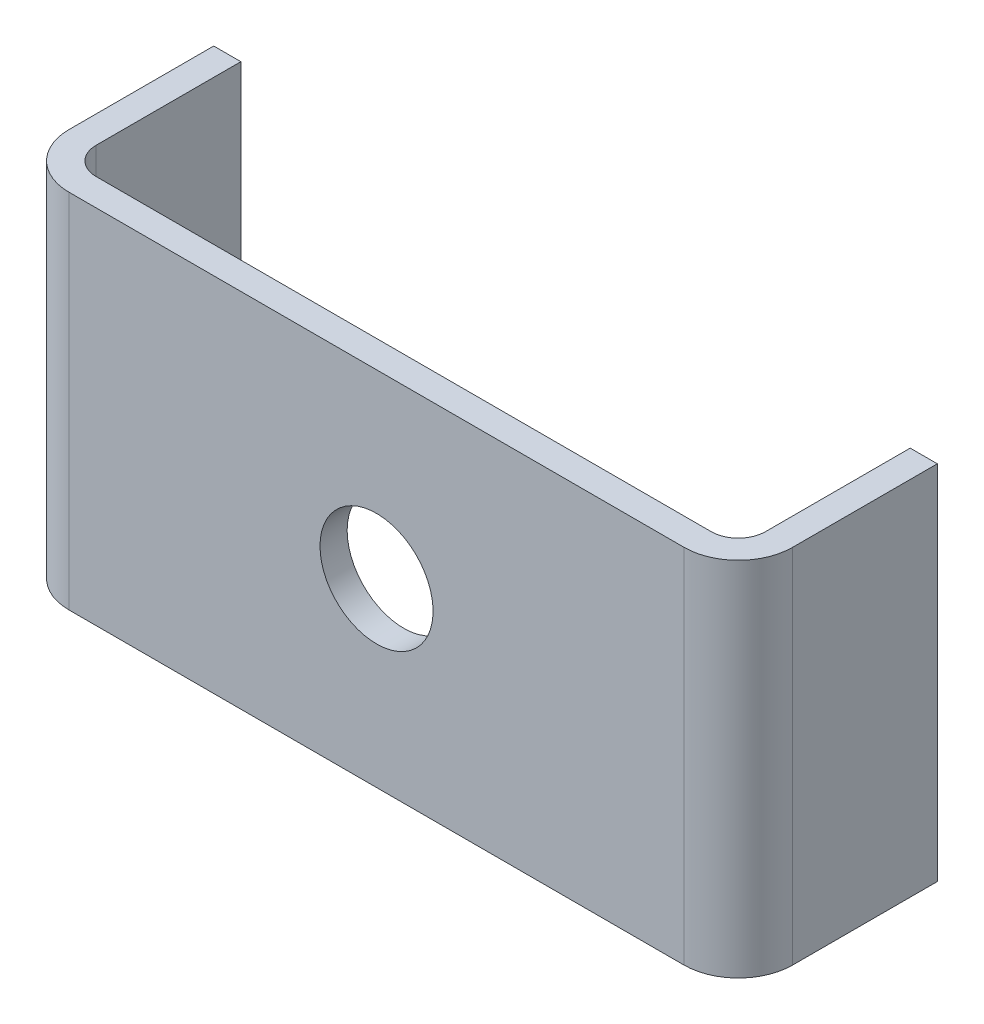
ISO-10303-21;
HEADER;
FILE_DESCRIPTION(('STEP AP214'),'2;1');
FILE_NAME('part.step','',(''),(''),'','','');
FILE_SCHEMA(('AUTOMOTIVE_DESIGN { 1 0 10303 214 1 1 1 1 }'));
ENDSEC;
DATA;
#1=APPLICATION_CONTEXT('core data for automotive mechanical design processes');
#2=APPLICATION_PROTOCOL_DEFINITION('international standard','automotive_design',2000,#1);
#3=PRODUCT_CONTEXT('',#1,'mechanical');
#4=PRODUCT('Part','Part','',(#3));
#5=PRODUCT_RELATED_PRODUCT_CATEGORY('part','',(#4));
#6=PRODUCT_DEFINITION_FORMATION('','',#4);
#7=PRODUCT_DEFINITION_CONTEXT('part definition',#1,'design');
#8=PRODUCT_DEFINITION('design','',#6,#7);
#9=PRODUCT_DEFINITION_SHAPE('','',#8);
#10=(LENGTH_UNIT() NAMED_UNIT(*) SI_UNIT(.MILLI.,.METRE.));
#11=(NAMED_UNIT(*) PLANE_ANGLE_UNIT() SI_UNIT($,.RADIAN.));
#12=(NAMED_UNIT(*) SI_UNIT($,.STERADIAN.) SOLID_ANGLE_UNIT());
#13=UNCERTAINTY_MEASURE_WITH_UNIT(LENGTH_MEASURE(1.E-05),#10,'distance_accuracy_value','');
#14=(GEOMETRIC_REPRESENTATION_CONTEXT(3) GLOBAL_UNCERTAINTY_ASSIGNED_CONTEXT((#13)) GLOBAL_UNIT_ASSIGNED_CONTEXT((#10,
#11,#12)) REPRESENTATION_CONTEXT('',''));
#15=CARTESIAN_POINT('',(0.,0.,0.));
#16=DIRECTION('',(0.,0.,1.));
#17=DIRECTION('',(1.,0.,0.));
#18=AXIS2_PLACEMENT_3D('',#15,#16,#17);
#19=CARTESIAN_POINT('',(0.,0.,-22.));
#20=DIRECTION('',(0.,0.,-1.));
#21=DIRECTION('',(-1.,0.,0.));
#22=AXIS2_PLACEMENT_3D('',#19,#20,#21);
#23=PLANE('',#22);
#24=DIRECTION('',(0.,-1.,0.));
#25=VECTOR('',#24,1.);
#26=CARTESIAN_POINT('',(-37.,20.,-22.));
#27=LINE('',#26,#25);
#28=CARTESIAN_POINT('',(-37.,20.,-22.));
#29=VERTEX_POINT('',#28);
#30=CARTESIAN_POINT('',(-37.,-20.,-22.));
#31=VERTEX_POINT('',#30);
#32=EDGE_CURVE('E143',#29,#31,#27,.T.);
#33=ORIENTED_EDGE('',*,*,#32,.T.);
#34=DIRECTION('',(-1.,0.,0.));
#35=VECTOR('',#34,1.);
#36=CARTESIAN_POINT('',(40.,-20.,-22.));
#37=LINE('',#36,#35);
#38=CARTESIAN_POINT('',(-40.,-20.,-22.));
#39=VERTEX_POINT('',#38);
#40=EDGE_CURVE('E150',#31,#39,#37,.T.);
#41=ORIENTED_EDGE('',*,*,#40,.T.);
#42=DIRECTION('',(0.,1.,0.));
#43=VECTOR('',#42,1.);
#44=CARTESIAN_POINT('',(-40.,-20.,-22.));
#45=LINE('',#44,#43);
#46=CARTESIAN_POINT('',(-40.,20.,-22.));
#47=VERTEX_POINT('',#46);
#48=EDGE_CURVE('E153',#39,#47,#45,.T.);
#49=ORIENTED_EDGE('',*,*,#48,.T.);
#50=DIRECTION('',(1.,0.,0.));
#51=VECTOR('',#50,1.);
#52=CARTESIAN_POINT('',(-40.,20.,-22.));
#53=LINE('',#52,#51);
#54=EDGE_CURVE('E131',#47,#29,#53,.T.);
#55=ORIENTED_EDGE('',*,*,#54,.T.);
#56=EDGE_LOOP('',(#33,#41,#49,#55));
#57=FACE_BOUND('',#56,.T.);
#58=ADVANCED_FACE('F35',(#57),#23,.T.);
#59=CARTESIAN_POINT('',(40.,-20.,0.));
#60=DIRECTION('',(0.,-1.,0.));
#61=DIRECTION('',(0.,0.,-1.));
#62=AXIS2_PLACEMENT_3D('',#59,#60,#61);
#63=PLANE('',#62);
#64=DIRECTION('',(-1.,0.,0.));
#65=VECTOR('',#64,1.);
#66=CARTESIAN_POINT('',(40.,-20.,0.));
#67=LINE('',#66,#65);
#68=CARTESIAN_POINT('',(34.,-20.,0.));
#69=VERTEX_POINT('',#68);
#70=CARTESIAN_POINT('',(-34.,-20.,0.));
#71=VERTEX_POINT('',#70);
#72=EDGE_CURVE('E158',#69,#71,#67,.T.);
#73=ORIENTED_EDGE('',*,*,#72,.T.);
#74=CARTESIAN_POINT('',(-34.,-20.,-6.));
#75=DIRECTION('',(0.,-1.,0.));
#76=DIRECTION('',(0.,0.,-1.));
#77=AXIS2_PLACEMENT_3D('',#74,#75,#76);
#78=CIRCLE('',#77,6.);
#79=CARTESIAN_POINT('',(-40.,-20.,-6.));
#80=VERTEX_POINT('',#79);
#81=EDGE_CURVE('E43',#71,#80,#78,.T.);
#82=ORIENTED_EDGE('',*,*,#81,.T.);
#83=DIRECTION('',(0.,0.,-1.));
#84=VECTOR('',#83,1.);
#85=CARTESIAN_POINT('',(-40.,-20.,0.));
#86=LINE('',#85,#84);
#87=EDGE_CURVE('E171',#80,#39,#86,.T.);
#88=ORIENTED_EDGE('',*,*,#87,.T.);
#89=ORIENTED_EDGE('',*,*,#40,.F.);
#90=DIRECTION('',(0.,0.,-1.));
#91=VECTOR('',#90,1.);
#92=CARTESIAN_POINT('',(-37.,-20.,-3.));
#93=LINE('',#92,#91);
#94=CARTESIAN_POINT('',(-37.,-20.,-6.));
#95=VERTEX_POINT('',#94);
#96=EDGE_CURVE('E146',#95,#31,#93,.T.);
#97=ORIENTED_EDGE('',*,*,#96,.F.);
#98=CARTESIAN_POINT('',(-34.,-20.,-6.));
#99=DIRECTION('',(0.,-1.,0.));
#100=DIRECTION('',(0.,0.,-1.));
#101=AXIS2_PLACEMENT_3D('',#98,#99,#100);
#102=CIRCLE('',#101,3.);
#103=CARTESIAN_POINT('',(-34.,-20.,-3.));
#104=VERTEX_POINT('',#103);
#105=EDGE_CURVE('E186',#95,#104,#102,.F.);
#106=ORIENTED_EDGE('',*,*,#105,.T.);
#107=DIRECTION('',(-1.,0.,0.));
#108=VECTOR('',#107,1.);
#109=CARTESIAN_POINT('',(37.,-20.,-3.));
#110=LINE('',#109,#108);
#111=CARTESIAN_POINT('',(34.,-20.,-3.));
#112=VERTEX_POINT('',#111);
#113=EDGE_CURVE('E222',#112,#104,#110,.T.);
#114=ORIENTED_EDGE('',*,*,#113,.F.);
#115=CARTESIAN_POINT('',(34.,-20.,-6.));
#116=DIRECTION('',(0.,-1.,0.));
#117=DIRECTION('',(0.,0.,-1.));
#118=AXIS2_PLACEMENT_3D('',#115,#116,#117);
#119=CIRCLE('',#118,3.);
#120=CARTESIAN_POINT('',(37.,-20.,-6.));
#121=VERTEX_POINT('',#120);
#122=EDGE_CURVE('E182',#112,#121,#119,.F.);
#123=ORIENTED_EDGE('',*,*,#122,.T.);
#124=DIRECTION('',(0.,0.,1.));
#125=VECTOR('',#124,1.);
#126=CARTESIAN_POINT('',(37.,-20.,-22.));
#127=LINE('',#126,#125);
#128=CARTESIAN_POINT('',(37.,-20.,-22.));
#129=VERTEX_POINT('',#128);
#130=EDGE_CURVE('E226',#129,#121,#127,.T.);
#131=ORIENTED_EDGE('',*,*,#130,.F.);
#132=CARTESIAN_POINT('',(40.,-20.,-22.));
#133=VERTEX_POINT('',#132);
#134=EDGE_CURVE('E214',#133,#129,#37,.T.);
#135=ORIENTED_EDGE('',*,*,#134,.F.);
#136=DIRECTION('',(0.,0.,-1.));
#137=VECTOR('',#136,1.);
#138=CARTESIAN_POINT('',(40.,-20.,0.));
#139=LINE('',#138,#137);
#140=CARTESIAN_POINT('',(40.,-20.,-6.));
#141=VERTEX_POINT('',#140);
#142=EDGE_CURVE('E164',#141,#133,#139,.T.);
#143=ORIENTED_EDGE('',*,*,#142,.F.);
#144=CARTESIAN_POINT('',(34.,-20.,-6.));
#145=DIRECTION('',(0.,-1.,0.));
#146=DIRECTION('',(0.,0.,-1.));
#147=AXIS2_PLACEMENT_3D('',#144,#145,#146);
#148=CIRCLE('',#147,6.);
#149=EDGE_CURVE('E50',#141,#69,#148,.T.);
#150=ORIENTED_EDGE('',*,*,#149,.T.);
#151=EDGE_LOOP('',(#73,#82,#88,#89,#97,#106,#114,#123,#131,#135,#143,#150));
#152=FACE_BOUND('',#151,.T.);
#153=ADVANCED_FACE('F202',(#152),#63,.T.);
#154=CARTESIAN_POINT('',(40.,20.,0.));
#155=DIRECTION('',(1.,0.,0.));
#156=DIRECTION('',(0.,0.,-1.));
#157=AXIS2_PLACEMENT_3D('',#154,#155,#156);
#158=PLANE('',#157);
#159=DIRECTION('',(0.,0.,-1.));
#160=VECTOR('',#159,1.);
#161=CARTESIAN_POINT('',(40.,20.,0.));
#162=LINE('',#161,#160);
#163=CARTESIAN_POINT('',(40.,20.,-6.));
#164=VERTEX_POINT('',#163);
#165=CARTESIAN_POINT('',(40.,20.,-22.));
#166=VERTEX_POINT('',#165);
#167=EDGE_CURVE('E167',#164,#166,#162,.T.);
#168=ORIENTED_EDGE('',*,*,#167,.F.);
#169=DIRECTION('',(0.,-1.,0.));
#170=VECTOR('',#169,1.);
#171=CARTESIAN_POINT('',(40.,-20.,-6.));
#172=LINE('',#171,#170);
#173=EDGE_CURVE('E11',#164,#141,#172,.T.);
#174=ORIENTED_EDGE('',*,*,#173,.T.);
#175=ORIENTED_EDGE('',*,*,#142,.T.);
#176=DIRECTION('',(0.,-1.,0.));
#177=VECTOR('',#176,1.);
#178=CARTESIAN_POINT('',(40.,20.,-22.));
#179=LINE('',#178,#177);
#180=EDGE_CURVE('E154',#166,#133,#179,.T.);
#181=ORIENTED_EDGE('',*,*,#180,.F.);
#182=EDGE_LOOP('',(#168,#174,#175,#181));
#183=FACE_BOUND('',#182,.T.);
#184=ADVANCED_FACE('F261',(#183),#158,.T.);
#185=CARTESIAN_POINT('',(-40.,20.,0.));
#186=DIRECTION('',(0.,1.,0.));
#187=DIRECTION('',(0.,0.,1.));
#188=AXIS2_PLACEMENT_3D('',#185,#186,#187);
#189=PLANE('',#188);
#190=DIRECTION('',(0.,0.,-1.));
#191=VECTOR('',#190,1.);
#192=CARTESIAN_POINT('',(-40.,20.,0.));
#193=LINE('',#192,#191);
#194=CARTESIAN_POINT('',(-40.,20.,-6.));
#195=VERTEX_POINT('',#194);
#196=EDGE_CURVE('E169',#195,#47,#193,.T.);
#197=ORIENTED_EDGE('',*,*,#196,.F.);
#198=CARTESIAN_POINT('',(-34.,20.,-6.));
#199=DIRECTION('',(0.,1.,0.));
#200=DIRECTION('',(0.,0.,1.));
#201=AXIS2_PLACEMENT_3D('',#198,#199,#200);
#202=CIRCLE('',#201,6.);
#203=CARTESIAN_POINT('',(-34.,20.,0.));
#204=VERTEX_POINT('',#203);
#205=EDGE_CURVE('E194',#195,#204,#202,.T.);
#206=ORIENTED_EDGE('',*,*,#205,.T.);
#207=DIRECTION('',(1.,0.,0.));
#208=VECTOR('',#207,1.);
#209=CARTESIAN_POINT('',(-40.,20.,0.));
#210=LINE('',#209,#208);
#211=CARTESIAN_POINT('',(34.,20.,0.));
#212=VERTEX_POINT('',#211);
#213=EDGE_CURVE('E173',#204,#212,#210,.T.);
#214=ORIENTED_EDGE('',*,*,#213,.T.);
#215=CARTESIAN_POINT('',(34.,20.,-6.));
#216=DIRECTION('',(0.,1.,0.));
#217=DIRECTION('',(0.,0.,1.));
#218=AXIS2_PLACEMENT_3D('',#215,#216,#217);
#219=CIRCLE('',#218,6.);
#220=EDGE_CURVE('E192',#212,#164,#219,.T.);
#221=ORIENTED_EDGE('',*,*,#220,.T.);
#222=ORIENTED_EDGE('',*,*,#167,.T.);
#223=CARTESIAN_POINT('',(37.,20.,-22.));
#224=VERTEX_POINT('',#223);
#225=EDGE_CURVE('E155',#224,#166,#53,.T.);
#226=ORIENTED_EDGE('',*,*,#225,.F.);
#227=DIRECTION('',(0.,0.,1.));
#228=VECTOR('',#227,1.);
#229=CARTESIAN_POINT('',(37.,20.,-22.));
#230=LINE('',#229,#228);
#231=CARTESIAN_POINT('',(37.,20.,-6.));
#232=VERTEX_POINT('',#231);
#233=EDGE_CURVE('E221',#224,#232,#230,.T.);
#234=ORIENTED_EDGE('',*,*,#233,.T.);
#235=CARTESIAN_POINT('',(34.,20.,-6.));
#236=DIRECTION('',(0.,1.,0.));
#237=DIRECTION('',(0.,0.,1.));
#238=AXIS2_PLACEMENT_3D('',#235,#236,#237);
#239=CIRCLE('',#238,3.);
#240=CARTESIAN_POINT('',(34.,20.,-3.));
#241=VERTEX_POINT('',#240);
#242=EDGE_CURVE('E184',#232,#241,#239,.F.);
#243=ORIENTED_EDGE('',*,*,#242,.T.);
#244=DIRECTION('',(-1.,0.,0.));
#245=VECTOR('',#244,1.);
#246=CARTESIAN_POINT('',(37.,20.,-3.));
#247=LINE('',#246,#245);
#248=CARTESIAN_POINT('',(-34.,20.,-3.));
#249=VERTEX_POINT('',#248);
#250=EDGE_CURVE('E140',#241,#249,#247,.T.);
#251=ORIENTED_EDGE('',*,*,#250,.T.);
#252=CARTESIAN_POINT('',(-34.,20.,-6.));
#253=DIRECTION('',(0.,1.,0.));
#254=DIRECTION('',(0.,0.,1.));
#255=AXIS2_PLACEMENT_3D('',#252,#253,#254);
#256=CIRCLE('',#255,3.);
#257=CARTESIAN_POINT('',(-37.,20.,-6.));
#258=VERTEX_POINT('',#257);
#259=EDGE_CURVE('E135',#249,#258,#256,.F.);
#260=ORIENTED_EDGE('',*,*,#259,.T.);
#261=DIRECTION('',(0.,0.,-1.));
#262=VECTOR('',#261,1.);
#263=CARTESIAN_POINT('',(-37.,20.,-3.));
#264=LINE('',#263,#262);
#265=EDGE_CURVE('E126',#258,#29,#264,.T.);
#266=ORIENTED_EDGE('',*,*,#265,.T.);
#267=ORIENTED_EDGE('',*,*,#54,.F.);
#268=EDGE_LOOP('',(#197,#206,#214,#221,#222,#226,#234,#243,#251,#260,#266,#267));
#269=FACE_BOUND('',#268,.T.);
#270=ADVANCED_FACE('F129',(#269),#189,.T.);
#271=CARTESIAN_POINT('',(-40.,-20.,0.));
#272=DIRECTION('',(-1.,0.,0.));
#273=DIRECTION('',(0.,0.,1.));
#274=AXIS2_PLACEMENT_3D('',#271,#272,#273);
#275=PLANE('',#274);
#276=ORIENTED_EDGE('',*,*,#87,.F.);
#277=DIRECTION('',(0.,1.,0.));
#278=VECTOR('',#277,1.);
#279=CARTESIAN_POINT('',(-40.,20.,-6.));
#280=LINE('',#279,#278);
#281=EDGE_CURVE('E189',#80,#195,#280,.T.);
#282=ORIENTED_EDGE('',*,*,#281,.T.);
#283=ORIENTED_EDGE('',*,*,#196,.T.);
#284=ORIENTED_EDGE('',*,*,#48,.F.);
#285=EDGE_LOOP('',(#276,#282,#283,#284));
#286=FACE_BOUND('',#285,.T.);
#287=ADVANCED_FACE('F206',(#286),#275,.T.);
#288=CARTESIAN_POINT('',(0.,0.,0.));
#289=DIRECTION('',(0.,0.,-1.));
#290=DIRECTION('',(-1.,0.,0.));
#291=AXIS2_PLACEMENT_3D('',#288,#289,#290);
#292=PLANE('',#291);
#293=CARTESIAN_POINT('',(0.,0.,0.));
#294=DIRECTION('',(0.,0.,-1.));
#295=DIRECTION('',(-1.,0.,0.));
#296=AXIS2_PLACEMENT_3D('',#293,#294,#295);
#297=CIRCLE('',#296,6.24999999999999);
#298=CARTESIAN_POINT('',(-6.24999999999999,0.,0.));
#299=VERTEX_POINT('',#298);
#300=EDGE_CURVE('E236',#299,#299,#297,.T.);
#301=ORIENTED_EDGE('',*,*,#300,.T.);
#302=EDGE_LOOP('',(#301));
#303=FACE_BOUND('',#302,.T.);
#304=ORIENTED_EDGE('',*,*,#213,.F.);
#305=DIRECTION('',(0.,1.,0.));
#306=VECTOR('',#305,1.);
#307=CARTESIAN_POINT('',(-34.,-20.,0.));
#308=LINE('',#307,#306);
#309=EDGE_CURVE('E57',#204,#71,#308,.F.);
#310=ORIENTED_EDGE('',*,*,#309,.T.);
#311=ORIENTED_EDGE('',*,*,#72,.F.);
#312=DIRECTION('',(0.,-1.,0.));
#313=VECTOR('',#312,1.);
#314=CARTESIAN_POINT('',(34.,20.,0.));
#315=LINE('',#314,#313);
#316=EDGE_CURVE('E196',#69,#212,#315,.F.);
#317=ORIENTED_EDGE('',*,*,#316,.T.);
#318=EDGE_LOOP('',(#304,#310,#311,#317));
#319=FACE_BOUND('',#318,.T.);
#320=ADVANCED_FACE('F210',(#303,#319),#292,.F.);
#321=DIRECTION('',(0.,-1.,0.));
#322=VECTOR('',#321,1.);
#323=CARTESIAN_POINT('',(37.,20.,-22.));
#324=LINE('',#323,#322);
#325=EDGE_CURVE('E139',#224,#129,#324,.T.);
#326=ORIENTED_EDGE('',*,*,#325,.F.);
#327=ORIENTED_EDGE('',*,*,#225,.T.);
#328=ORIENTED_EDGE('',*,*,#180,.T.);
#329=ORIENTED_EDGE('',*,*,#134,.T.);
#330=EDGE_LOOP('',(#326,#327,#328,#329));
#331=FACE_BOUND('',#330,.T.);
#332=ADVANCED_FACE('F259',(#331),#23,.T.);
#333=CARTESIAN_POINT('',(-37.,20.,-3.));
#334=DIRECTION('',(-1.,0.,0.));
#335=DIRECTION('',(0.,0.,1.));
#336=AXIS2_PLACEMENT_3D('',#333,#334,#335);
#337=PLANE('',#336);
#338=ORIENTED_EDGE('',*,*,#265,.F.);
#339=DIRECTION('',(0.,-1.,0.));
#340=VECTOR('',#339,1.);
#341=CARTESIAN_POINT('',(-37.,-20.,-6.));
#342=LINE('',#341,#340);
#343=EDGE_CURVE('E180',#258,#95,#342,.T.);
#344=ORIENTED_EDGE('',*,*,#343,.T.);
#345=ORIENTED_EDGE('',*,*,#96,.T.);
#346=ORIENTED_EDGE('',*,*,#32,.F.);
#347=EDGE_LOOP('',(#338,#344,#345,#346));
#348=FACE_BOUND('',#347,.T.);
#349=ADVANCED_FACE('F144',(#348),#337,.F.);
#350=CARTESIAN_POINT('',(37.,20.,-3.));
#351=DIRECTION('',(0.,0.,1.));
#352=DIRECTION('',(1.,0.,0.));
#353=AXIS2_PLACEMENT_3D('',#350,#351,#352);
#354=PLANE('',#353);
#355=CARTESIAN_POINT('',(0.,0.,-3.));
#356=DIRECTION('',(0.,0.,-1.));
#357=DIRECTION('',(-1.,0.,0.));
#358=AXIS2_PLACEMENT_3D('',#355,#356,#357);
#359=CIRCLE('',#358,6.24999999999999);
#360=CARTESIAN_POINT('',(-6.24999999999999,0.,-3.));
#361=VERTEX_POINT('',#360);
#362=EDGE_CURVE('E238',#361,#361,#359,.T.);
#363=ORIENTED_EDGE('',*,*,#362,.F.);
#364=EDGE_LOOP('',(#363));
#365=FACE_BOUND('',#364,.T.);
#366=ORIENTED_EDGE('',*,*,#250,.F.);
#367=DIRECTION('',(0.,-1.,0.));
#368=VECTOR('',#367,1.);
#369=CARTESIAN_POINT('',(34.,-20.,-3.));
#370=LINE('',#369,#368);
#371=EDGE_CURVE('E175',#241,#112,#370,.T.);
#372=ORIENTED_EDGE('',*,*,#371,.T.);
#373=ORIENTED_EDGE('',*,*,#113,.T.);
#374=DIRECTION('',(0.,-1.,0.));
#375=VECTOR('',#374,1.);
#376=CARTESIAN_POINT('',(-34.,20.,-3.));
#377=LINE('',#376,#375);
#378=EDGE_CURVE('E166',#104,#249,#377,.F.);
#379=ORIENTED_EDGE('',*,*,#378,.T.);
#380=EDGE_LOOP('',(#366,#372,#373,#379));
#381=FACE_BOUND('',#380,.T.);
#382=ADVANCED_FACE('F247',(#365,#381),#354,.F.);
#383=CARTESIAN_POINT('',(37.,20.,-22.));
#384=DIRECTION('',(1.,0.,0.));
#385=DIRECTION('',(0.,0.,-1.));
#386=AXIS2_PLACEMENT_3D('',#383,#384,#385);
#387=PLANE('',#386);
#388=ORIENTED_EDGE('',*,*,#130,.T.);
#389=DIRECTION('',(0.,-1.,0.));
#390=VECTOR('',#389,1.);
#391=CARTESIAN_POINT('',(37.,20.,-6.));
#392=LINE('',#391,#390);
#393=EDGE_CURVE('E178',#121,#232,#392,.F.);
#394=ORIENTED_EDGE('',*,*,#393,.T.);
#395=ORIENTED_EDGE('',*,*,#233,.F.);
#396=ORIENTED_EDGE('',*,*,#325,.T.);
#397=EDGE_LOOP('',(#388,#394,#395,#396));
#398=FACE_BOUND('',#397,.T.);
#399=ADVANCED_FACE('F232',(#398),#387,.F.);
#400=CARTESIAN_POINT('',(0.,0.,-3.));
#401=DIRECTION('',(0.,0.,-1.));
#402=DIRECTION('',(-1.,0.,0.));
#403=AXIS2_PLACEMENT_3D('',#400,#401,#402);
#404=CYLINDRICAL_SURFACE('',#403,6.24999999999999);
#405=ORIENTED_EDGE('',*,*,#300,.F.);
#406=EDGE_LOOP('',(#405));
#407=FACE_BOUND('',#406,.T.);
#408=ORIENTED_EDGE('',*,*,#362,.T.);
#409=EDGE_LOOP('',(#408));
#410=FACE_BOUND('',#409,.T.);
#411=ADVANCED_FACE('F245',(#407,#410),#404,.F.);
#412=CARTESIAN_POINT('',(34.,20.,-6.));
#413=DIRECTION('',(0.,1.,0.));
#414=DIRECTION('',(0.,0.,1.));
#415=AXIS2_PLACEMENT_3D('',#412,#413,#414);
#416=CYLINDRICAL_SURFACE('',#415,3.);
#417=ORIENTED_EDGE('',*,*,#242,.F.);
#418=ORIENTED_EDGE('',*,*,#393,.F.);
#419=ORIENTED_EDGE('',*,*,#122,.F.);
#420=ORIENTED_EDGE('',*,*,#371,.F.);
#421=EDGE_LOOP('',(#417,#418,#419,#420));
#422=FACE_BOUND('',#421,.T.);
#423=ADVANCED_FACE('F256',(#422),#416,.F.);
#424=CARTESIAN_POINT('',(-34.,20.,-6.));
#425=DIRECTION('',(0.,1.,0.));
#426=DIRECTION('',(0.,0.,1.));
#427=AXIS2_PLACEMENT_3D('',#424,#425,#426);
#428=CYLINDRICAL_SURFACE('',#427,3.);
#429=ORIENTED_EDGE('',*,*,#259,.F.);
#430=ORIENTED_EDGE('',*,*,#378,.F.);
#431=ORIENTED_EDGE('',*,*,#105,.F.);
#432=ORIENTED_EDGE('',*,*,#343,.F.);
#433=EDGE_LOOP('',(#429,#430,#431,#432));
#434=FACE_BOUND('',#433,.T.);
#435=ADVANCED_FACE('F266',(#434),#428,.F.);
#436=CARTESIAN_POINT('',(-34.,-20.,-6.));
#437=DIRECTION('',(0.,-1.,0.));
#438=DIRECTION('',(0.,0.,-1.));
#439=AXIS2_PLACEMENT_3D('',#436,#437,#438);
#440=CYLINDRICAL_SURFACE('',#439,6.);
#441=ORIENTED_EDGE('',*,*,#81,.F.);
#442=ORIENTED_EDGE('',*,*,#309,.F.);
#443=ORIENTED_EDGE('',*,*,#205,.F.);
#444=ORIENTED_EDGE('',*,*,#281,.F.);
#445=EDGE_LOOP('',(#441,#442,#443,#444));
#446=FACE_BOUND('',#445,.T.);
#447=ADVANCED_FACE('F207',(#446),#440,.T.);
#448=CARTESIAN_POINT('',(34.,20.,-6.));
#449=DIRECTION('',(0.,1.,0.));
#450=DIRECTION('',(0.,0.,1.));
#451=AXIS2_PLACEMENT_3D('',#448,#449,#450);
#452=CYLINDRICAL_SURFACE('',#451,6.);
#453=ORIENTED_EDGE('',*,*,#220,.F.);
#454=ORIENTED_EDGE('',*,*,#316,.F.);
#455=ORIENTED_EDGE('',*,*,#149,.F.);
#456=ORIENTED_EDGE('',*,*,#173,.F.);
#457=EDGE_LOOP('',(#453,#454,#455,#456));
#458=FACE_BOUND('',#457,.T.);
#459=ADVANCED_FACE('F37',(#458),#452,.T.);
#460=CLOSED_SHELL('',(#58,#153,#184,#270,#287,#320,#332,#349,#382,#399,#411,#423,#435,#447,#459));
#461=MANIFOLD_SOLID_BREP('B2',#460);
#462=ADVANCED_BREP_SHAPE_REPRESENTATION('',(#18,#461),#14);
#463=SHAPE_DEFINITION_REPRESENTATION(#9,#462);
ENDSEC;
END-ISO-10303-21;
